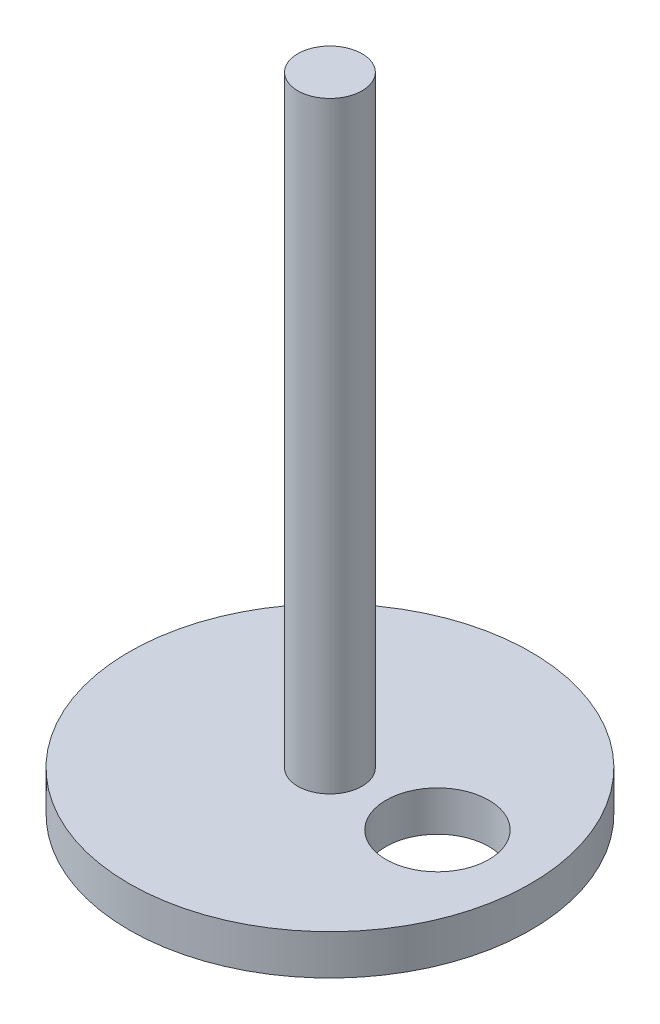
ISO-10303-21;
HEADER;
FILE_DESCRIPTION(('STEP AP214'),'2;1');
FILE_NAME('part.step','',(''),(''),'','','');
FILE_SCHEMA(('AUTOMOTIVE_DESIGN { 1 0 10303 214 1 1 1 1 }'));
ENDSEC;
DATA;
#1=APPLICATION_CONTEXT('core data for automotive mechanical design processes');
#2=APPLICATION_PROTOCOL_DEFINITION('international standard','automotive_design',2000,#1);
#3=PRODUCT_CONTEXT('',#1,'mechanical');
#4=PRODUCT('Part','Part','',(#3));
#5=PRODUCT_RELATED_PRODUCT_CATEGORY('part','',(#4));
#6=PRODUCT_DEFINITION_FORMATION('','',#4);
#7=PRODUCT_DEFINITION_CONTEXT('part definition',#1,'design');
#8=PRODUCT_DEFINITION('design','',#6,#7);
#9=PRODUCT_DEFINITION_SHAPE('','',#8);
#10=(LENGTH_UNIT() NAMED_UNIT(*) SI_UNIT(.MILLI.,.METRE.));
#11=(NAMED_UNIT(*) PLANE_ANGLE_UNIT() SI_UNIT($,.RADIAN.));
#12=(NAMED_UNIT(*) SI_UNIT($,.STERADIAN.) SOLID_ANGLE_UNIT());
#13=UNCERTAINTY_MEASURE_WITH_UNIT(LENGTH_MEASURE(1.E-05),#10,'distance_accuracy_value','');
#14=(GEOMETRIC_REPRESENTATION_CONTEXT(3) GLOBAL_UNCERTAINTY_ASSIGNED_CONTEXT((#13)) GLOBAL_UNIT_ASSIGNED_CONTEXT((#10,
#11,#12)) REPRESENTATION_CONTEXT('',''));
#15=CARTESIAN_POINT('',(0.,0.,0.));
#16=DIRECTION('',(0.,0.,1.));
#17=DIRECTION('',(1.,0.,0.));
#18=AXIS2_PLACEMENT_3D('',#15,#16,#17);
#19=CARTESIAN_POINT('',(0.,10.,0.));
#20=DIRECTION('',(0.,-1.,0.));
#21=DIRECTION('',(0.,0.,-1.));
#22=AXIS2_PLACEMENT_3D('',#19,#20,#21);
#23=CYLINDRICAL_SURFACE('',#22,50.);
#24=CARTESIAN_POINT('',(0.,10.,0.));
#25=DIRECTION('',(0.,1.,0.));
#26=DIRECTION('',(0.,0.,1.));
#27=AXIS2_PLACEMENT_3D('',#24,#25,#26);
#28=CIRCLE('',#27,50.);
#29=CARTESIAN_POINT('',(0.,10.,50.));
#30=VERTEX_POINT('',#29);
#31=EDGE_CURVE('E49',#30,#30,#28,.T.);
#32=ORIENTED_EDGE('',*,*,#31,.F.);
#33=EDGE_LOOP('',(#32));
#34=FACE_BOUND('',#33,.T.);
#35=CARTESIAN_POINT('',(0.,0.,0.));
#36=DIRECTION('',(0.,1.,0.));
#37=DIRECTION('',(0.,0.,1.));
#38=AXIS2_PLACEMENT_3D('',#35,#36,#37);
#39=CIRCLE('',#38,50.);
#40=CARTESIAN_POINT('',(0.,0.,50.));
#41=VERTEX_POINT('',#40);
#42=EDGE_CURVE('E44',#41,#41,#39,.T.);
#43=ORIENTED_EDGE('',*,*,#42,.T.);
#44=EDGE_LOOP('',(#43));
#45=FACE_BOUND('',#44,.T.);
#46=ADVANCED_FACE('F41',(#34,#45),#23,.T.);
#47=CARTESIAN_POINT('',(0.,10.,0.));
#48=DIRECTION('',(0.,1.,0.));
#49=DIRECTION('',(0.,0.,1.));
#50=AXIS2_PLACEMENT_3D('',#47,#48,#49);
#51=PLANE('',#50);
#52=CARTESIAN_POINT('',(26.7753319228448,10.,0.));
#53=DIRECTION('',(0.,-1.,0.));
#54=DIRECTION('',(0.,0.,-1.));
#55=AXIS2_PLACEMENT_3D('',#52,#53,#54);
#56=CIRCLE('',#55,12.807098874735);
#57=CARTESIAN_POINT('',(26.7753319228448,10.,-12.807098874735));
#58=VERTEX_POINT('',#57);
#59=EDGE_CURVE('E60',#58,#58,#56,.T.);
#60=ORIENTED_EDGE('',*,*,#59,.T.);
#61=EDGE_LOOP('',(#60));
#62=FACE_BOUND('',#61,.T.);
#63=CARTESIAN_POINT('',(0.,10.,0.));
#64=DIRECTION('',(0.,1.,0.));
#65=DIRECTION('',(0.,0.,1.));
#66=AXIS2_PLACEMENT_3D('',#63,#64,#65);
#67=CIRCLE('',#66,8.);
#68=CARTESIAN_POINT('',(0.,10.,8.));
#69=VERTEX_POINT('',#68);
#70=EDGE_CURVE('E10',#69,#69,#67,.T.);
#71=ORIENTED_EDGE('',*,*,#70,.F.);
#72=EDGE_LOOP('',(#71));
#73=FACE_BOUND('',#72,.T.);
#74=ORIENTED_EDGE('',*,*,#31,.T.);
#75=EDGE_LOOP('',(#74));
#76=FACE_BOUND('',#75,.T.);
#77=ADVANCED_FACE('F69',(#62,#73,#76),#51,.T.);
#78=CARTESIAN_POINT('',(0.,0.,0.));
#79=DIRECTION('',(0.,1.,0.));
#80=DIRECTION('',(0.,0.,1.));
#81=AXIS2_PLACEMENT_3D('',#78,#79,#80);
#82=PLANE('',#81);
#83=CARTESIAN_POINT('',(26.7753319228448,0.,0.));
#84=DIRECTION('',(0.,-1.,0.));
#85=DIRECTION('',(0.,0.,-1.));
#86=AXIS2_PLACEMENT_3D('',#83,#84,#85);
#87=CIRCLE('',#86,12.807098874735);
#88=CARTESIAN_POINT('',(26.7753319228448,0.,-12.807098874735));
#89=VERTEX_POINT('',#88);
#90=EDGE_CURVE('E61',#89,#89,#87,.T.);
#91=ORIENTED_EDGE('',*,*,#90,.F.);
#92=EDGE_LOOP('',(#91));
#93=FACE_BOUND('',#92,.T.);
#94=ORIENTED_EDGE('',*,*,#42,.F.);
#95=EDGE_LOOP('',(#94));
#96=FACE_BOUND('',#95,.T.);
#97=ADVANCED_FACE('F79',(#93,#96),#82,.F.);
#98=CARTESIAN_POINT('',(0.,160.,0.));
#99=DIRECTION('',(0.,-1.,0.));
#100=DIRECTION('',(0.,0.,-1.));
#101=AXIS2_PLACEMENT_3D('',#98,#99,#100);
#102=CYLINDRICAL_SURFACE('',#101,8.);
#103=CARTESIAN_POINT('',(0.,160.,0.));
#104=DIRECTION('',(0.,1.,0.));
#105=DIRECTION('',(0.,0.,1.));
#106=AXIS2_PLACEMENT_3D('',#103,#104,#105);
#107=CIRCLE('',#106,8.);
#108=CARTESIAN_POINT('',(0.,160.,8.));
#109=VERTEX_POINT('',#108);
#110=EDGE_CURVE('E56',#109,#109,#107,.T.);
#111=ORIENTED_EDGE('',*,*,#110,.F.);
#112=EDGE_LOOP('',(#111));
#113=FACE_BOUND('',#112,.T.);
#114=ORIENTED_EDGE('',*,*,#70,.T.);
#115=EDGE_LOOP('',(#114));
#116=FACE_BOUND('',#115,.T.);
#117=ADVANCED_FACE('F82',(#113,#116),#102,.T.);
#118=CARTESIAN_POINT('',(0.,160.,0.));
#119=DIRECTION('',(0.,1.,0.));
#120=DIRECTION('',(0.,0.,1.));
#121=AXIS2_PLACEMENT_3D('',#118,#119,#120);
#122=PLANE('',#121);
#123=ORIENTED_EDGE('',*,*,#110,.T.);
#124=EDGE_LOOP('',(#123));
#125=FACE_BOUND('',#124,.T.);
#126=ADVANCED_FACE('F75',(#125),#122,.T.);
#127=CARTESIAN_POINT('',(26.7753319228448,10.,0.));
#128=DIRECTION('',(0.,-1.,0.));
#129=DIRECTION('',(0.,0.,-1.));
#130=AXIS2_PLACEMENT_3D('',#127,#128,#129);
#131=CYLINDRICAL_SURFACE('',#130,12.807098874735);
#132=ORIENTED_EDGE('',*,*,#59,.F.);
#133=EDGE_LOOP('',(#132));
#134=FACE_BOUND('',#133,.T.);
#135=ORIENTED_EDGE('',*,*,#90,.T.);
#136=EDGE_LOOP('',(#135));
#137=FACE_BOUND('',#136,.T.);
#138=ADVANCED_FACE('F72',(#134,#137),#131,.F.);
#139=CLOSED_SHELL('',(#46,#77,#97,#117,#126,#138));
#140=MANIFOLD_SOLID_BREP('B2',#139);
#141=ADVANCED_BREP_SHAPE_REPRESENTATION('',(#18,#140),#14);
#142=SHAPE_DEFINITION_REPRESENTATION(#9,#141);
ENDSEC;
END-ISO-10303-21;
